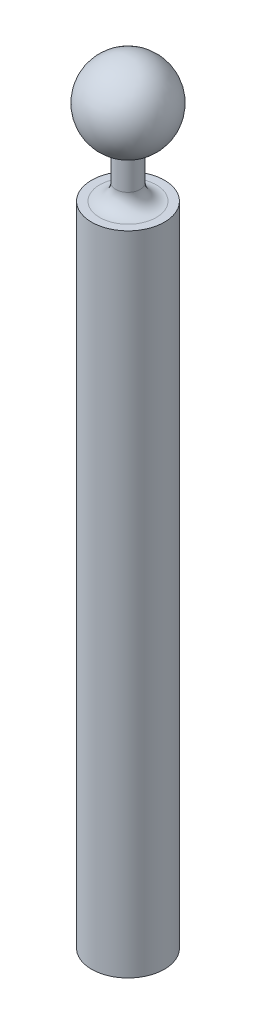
from build123d import *

# Parameters (mm, degrees)
ESQUISSE1_R        = 9
BOSS_EXTRU_1_DEPTH = 160
ESQUISSE2_R        = 3
BOSS_EXTRU_2_DEPTH = 15
CONG_1_R           = 4


with BuildPart() as part:
    # Esquisse1 → Boss.-Extru.1 (new body)
    with BuildSketch(Plane(origin=(0, 0, 0), x_dir=(1, 0, 0), z_dir=(0, 1, 0))):
        with Locations(Location((0, 0, 0), (0, 0, 270))):
            Circle(ESQUISSE1_R)
    extrude(amount=BOSS_EXTRU_1_DEPTH)

    # Esquisse2 → Boss.-Extru.2 (add)
    with BuildSketch(Plane(origin=(0, 160, 0), x_dir=(1, 0, 0), z_dir=(0, 1, 0))):
        with Locations(Location((0, 0, 0), (0, 0, 270))):
            Circle(ESQUISSE2_R)
    extrude(amount=BOSS_EXTRU_2_DEPTH)

    # Cong_1
    cong_1_edges = [part.edges().sort_by_distance(p)[0] for p in [
        (0, 160, -3),
    ]]
    fillet(cong_1_edges, radius=CONG_1_R)


with BuildPart() as body_2:
    # Esquisse3 → R_volution1 (revolve)
    with BuildSketch(Plane.XY):
        with BuildLine():
            Line((0, 171), (0, 191))
            ThreePointArc((0, 191), (10, 181), (0, 171))
        make_face()
    revolve(axis=Axis((0, 160, 0), (0, 1, 0)))


solid = Compound([part.part, body_2.part])
